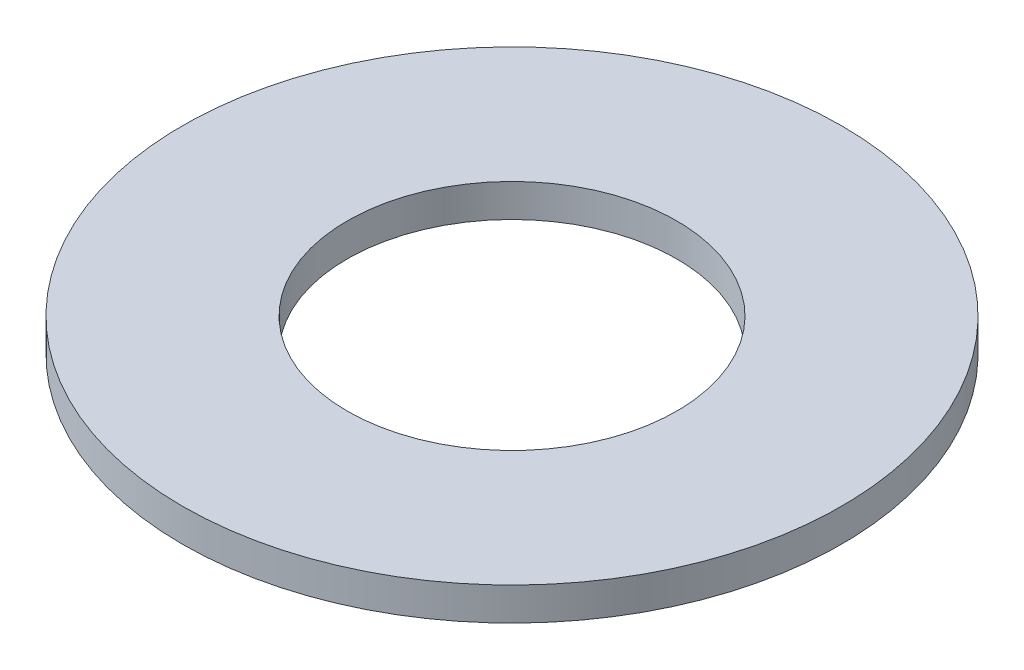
ISO-10303-21;
HEADER;
FILE_DESCRIPTION(('STEP AP214'),'2;1');
FILE_NAME('part.step','',(''),(''),'','','');
FILE_SCHEMA(('AUTOMOTIVE_DESIGN { 1 0 10303 214 1 1 1 1 }'));
ENDSEC;
DATA;
#1=APPLICATION_CONTEXT('core data for automotive mechanical design processes');
#2=APPLICATION_PROTOCOL_DEFINITION('international standard','automotive_design',2000,#1);
#3=PRODUCT_CONTEXT('',#1,'mechanical');
#4=PRODUCT('Part','Part','',(#3));
#5=PRODUCT_RELATED_PRODUCT_CATEGORY('part','',(#4));
#6=PRODUCT_DEFINITION_FORMATION('','',#4);
#7=PRODUCT_DEFINITION_CONTEXT('part definition',#1,'design');
#8=PRODUCT_DEFINITION('design','',#6,#7);
#9=PRODUCT_DEFINITION_SHAPE('','',#8);
#10=(LENGTH_UNIT() NAMED_UNIT(*) SI_UNIT(.MILLI.,.METRE.));
#11=(NAMED_UNIT(*) PLANE_ANGLE_UNIT() SI_UNIT($,.RADIAN.));
#12=(NAMED_UNIT(*) SI_UNIT($,.STERADIAN.) SOLID_ANGLE_UNIT());
#13=UNCERTAINTY_MEASURE_WITH_UNIT(LENGTH_MEASURE(1.E-05),#10,'distance_accuracy_value','');
#14=(GEOMETRIC_REPRESENTATION_CONTEXT(3) GLOBAL_UNCERTAINTY_ASSIGNED_CONTEXT((#13)) GLOBAL_UNIT_ASSIGNED_CONTEXT((#10,
#11,#12)) REPRESENTATION_CONTEXT('',''));
#15=CARTESIAN_POINT('',(0.,0.,0.));
#16=DIRECTION('',(0.,0.,1.));
#17=DIRECTION('',(1.,0.,0.));
#18=AXIS2_PLACEMENT_3D('',#15,#16,#17);
#19=CARTESIAN_POINT('',(0.,2.54,0.));
#20=DIRECTION('',(0.,1.,0.));
#21=DIRECTION('',(0.,0.,1.));
#22=AXIS2_PLACEMENT_3D('',#19,#20,#21);
#23=PLANE('',#22);
#24=CARTESIAN_POINT('',(0.,2.54,0.));
#25=DIRECTION('',(0.,1.,0.));
#26=DIRECTION('',(0.,0.,1.));
#27=AXIS2_PLACEMENT_3D('',#24,#25,#26);
#28=CIRCLE('',#27,25.4);
#29=CARTESIAN_POINT('',(0.,2.54,25.4));
#30=VERTEX_POINT('',#29);
#31=EDGE_CURVE('E10',#30,#30,#28,.T.);
#32=ORIENTED_EDGE('',*,*,#31,.T.);
#33=EDGE_LOOP('',(#32));
#34=FACE_BOUND('',#33,.T.);
#35=CARTESIAN_POINT('',(0.,2.54,0.));
#36=DIRECTION('',(0.,1.,0.));
#37=DIRECTION('',(0.,0.,1.));
#38=AXIS2_PLACEMENT_3D('',#35,#36,#37);
#39=CIRCLE('',#38,12.7);
#40=CARTESIAN_POINT('',(0.,2.54,12.7));
#41=VERTEX_POINT('',#40);
#42=EDGE_CURVE('E43',#41,#41,#39,.T.);
#43=ORIENTED_EDGE('',*,*,#42,.F.);
#44=EDGE_LOOP('',(#43));
#45=FACE_BOUND('',#44,.T.);
#46=ADVANCED_FACE('F32',(#34,#45),#23,.T.);
#47=CARTESIAN_POINT('',(0.,0.,0.));
#48=DIRECTION('',(0.,1.,0.));
#49=DIRECTION('',(0.,0.,1.));
#50=AXIS2_PLACEMENT_3D('',#47,#48,#49);
#51=PLANE('',#50);
#52=CARTESIAN_POINT('',(0.,0.,0.));
#53=DIRECTION('',(0.,1.,0.));
#54=DIRECTION('',(0.,0.,1.));
#55=AXIS2_PLACEMENT_3D('',#52,#53,#54);
#56=CIRCLE('',#55,25.4);
#57=CARTESIAN_POINT('',(0.,0.,25.4));
#58=VERTEX_POINT('',#57);
#59=EDGE_CURVE('E36',#58,#58,#56,.T.);
#60=ORIENTED_EDGE('',*,*,#59,.F.);
#61=EDGE_LOOP('',(#60));
#62=FACE_BOUND('',#61,.T.);
#63=CARTESIAN_POINT('',(0.,0.,0.));
#64=DIRECTION('',(0.,1.,0.));
#65=DIRECTION('',(0.,0.,1.));
#66=AXIS2_PLACEMENT_3D('',#63,#64,#65);
#67=CIRCLE('',#66,12.7);
#68=CARTESIAN_POINT('',(0.,0.,12.7));
#69=VERTEX_POINT('',#68);
#70=EDGE_CURVE('E45',#69,#69,#67,.T.);
#71=ORIENTED_EDGE('',*,*,#70,.T.);
#72=EDGE_LOOP('',(#71));
#73=FACE_BOUND('',#72,.T.);
#74=ADVANCED_FACE('F55',(#62,#73),#51,.F.);
#75=CARTESIAN_POINT('',(0.,2.54,0.));
#76=DIRECTION('',(0.,-1.,0.));
#77=DIRECTION('',(0.,0.,-1.));
#78=AXIS2_PLACEMENT_3D('',#75,#76,#77);
#79=CYLINDRICAL_SURFACE('',#78,25.4);
#80=ORIENTED_EDGE('',*,*,#31,.F.);
#81=EDGE_LOOP('',(#80));
#82=FACE_BOUND('',#81,.T.);
#83=ORIENTED_EDGE('',*,*,#59,.T.);
#84=EDGE_LOOP('',(#83));
#85=FACE_BOUND('',#84,.T.);
#86=ADVANCED_FACE('F34',(#82,#85),#79,.T.);
#87=CARTESIAN_POINT('',(0.,2.54,0.));
#88=DIRECTION('',(0.,-1.,0.));
#89=DIRECTION('',(0.,0.,-1.));
#90=AXIS2_PLACEMENT_3D('',#87,#88,#89);
#91=CYLINDRICAL_SURFACE('',#90,12.7);
#92=ORIENTED_EDGE('',*,*,#42,.T.);
#93=EDGE_LOOP('',(#92));
#94=FACE_BOUND('',#93,.T.);
#95=ORIENTED_EDGE('',*,*,#70,.F.);
#96=EDGE_LOOP('',(#95));
#97=FACE_BOUND('',#96,.T.);
#98=ADVANCED_FACE('F51',(#94,#97),#91,.F.);
#99=CLOSED_SHELL('',(#46,#74,#86,#98));
#100=MANIFOLD_SOLID_BREP('B2',#99);
#101=ADVANCED_BREP_SHAPE_REPRESENTATION('',(#18,#100),#14);
#102=SHAPE_DEFINITION_REPRESENTATION(#9,#101);
ENDSEC;
END-ISO-10303-21;
